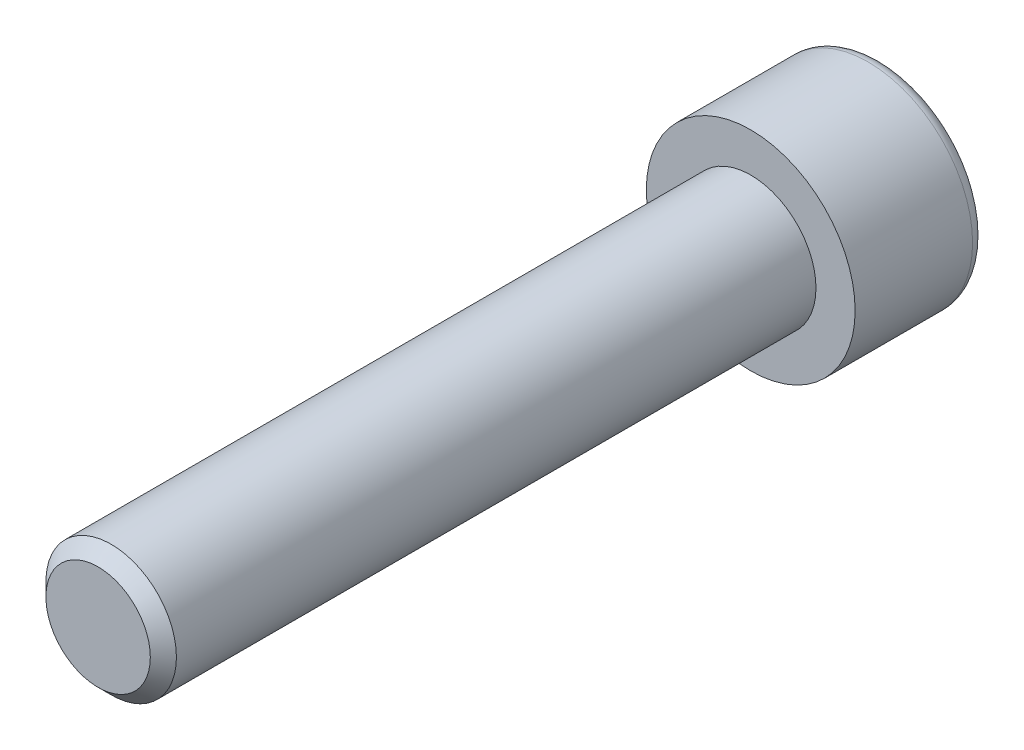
ISO-10303-21;
HEADER;
FILE_DESCRIPTION(('STEP AP214'),'2;1');
FILE_NAME('part.step','',(''),(''),'','','');
FILE_SCHEMA(('AUTOMOTIVE_DESIGN { 1 0 10303 214 1 1 1 1 }'));
ENDSEC;
DATA;
#1=APPLICATION_CONTEXT('core data for automotive mechanical design processes');
#2=APPLICATION_PROTOCOL_DEFINITION('international standard','automotive_design',2000,#1);
#3=PRODUCT_CONTEXT('',#1,'mechanical');
#4=PRODUCT('Part','Part','',(#3));
#5=PRODUCT_RELATED_PRODUCT_CATEGORY('part','',(#4));
#6=PRODUCT_DEFINITION_FORMATION('','',#4);
#7=PRODUCT_DEFINITION_CONTEXT('part definition',#1,'design');
#8=PRODUCT_DEFINITION('design','',#6,#7);
#9=PRODUCT_DEFINITION_SHAPE('','',#8);
#10=(LENGTH_UNIT() NAMED_UNIT(*) SI_UNIT(.MILLI.,.METRE.));
#11=(NAMED_UNIT(*) PLANE_ANGLE_UNIT() SI_UNIT($,.RADIAN.));
#12=(NAMED_UNIT(*) SI_UNIT($,.STERADIAN.) SOLID_ANGLE_UNIT());
#13=UNCERTAINTY_MEASURE_WITH_UNIT(LENGTH_MEASURE(1.E-05),#10,'distance_accuracy_value','');
#14=(GEOMETRIC_REPRESENTATION_CONTEXT(3) GLOBAL_UNCERTAINTY_ASSIGNED_CONTEXT((#13)) GLOBAL_UNIT_ASSIGNED_CONTEXT((#10,
#11,#12)) REPRESENTATION_CONTEXT('',''));
#15=CARTESIAN_POINT('',(0.,0.,0.));
#16=DIRECTION('',(0.,0.,1.));
#17=DIRECTION('',(1.,0.,0.));
#18=AXIS2_PLACEMENT_3D('',#15,#16,#17);
#19=CARTESIAN_POINT('',(0.,0.,-10.));
#20=DIRECTION('',(0.,0.,1.));
#21=DIRECTION('',(1.,0.,0.));
#22=AXIS2_PLACEMENT_3D('',#19,#20,#21);
#23=PLANE('',#22);
#24=CARTESIAN_POINT('',(0.,0.,-10.));
#25=DIRECTION('',(0.,0.,-1.));
#26=DIRECTION('',(-1.,0.,0.));
#27=AXIS2_PLACEMENT_3D('',#24,#25,#26);
#28=CIRCLE('',#27,7.);
#29=CARTESIAN_POINT('',(-7.00000000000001,0.,-10.));
#30=VERTEX_POINT('',#29);
#31=EDGE_CURVE('E141',#30,#30,#28,.T.);
#32=ORIENTED_EDGE('',*,*,#31,.T.);
#33=EDGE_LOOP('',(#32));
#34=FACE_BOUND('',#33,.T.);
#35=DIRECTION('',(-0.866025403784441,0.499999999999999,0.));
#36=VECTOR('',#35,1.);
#37=CARTESIAN_POINT('',(0.,4.61880215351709,-10.));
#38=LINE('',#37,#36);
#39=CARTESIAN_POINT('',(3.99999999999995,2.30940107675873,-10.));
#40=VERTEX_POINT('',#39);
#41=CARTESIAN_POINT('',(0.,4.61880215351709,-10.));
#42=VERTEX_POINT('',#41);
#43=EDGE_CURVE('E45',#40,#42,#38,.T.);
#44=ORIENTED_EDGE('',*,*,#43,.T.);
#45=DIRECTION('',(-0.866025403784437,-0.500000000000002,0.));
#46=VECTOR('',#45,1.);
#47=CARTESIAN_POINT('',(0.,4.61880215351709,-10.));
#48=LINE('',#47,#46);
#49=CARTESIAN_POINT('',(-3.99999999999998,2.30940107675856,-10.));
#50=VERTEX_POINT('',#49);
#51=EDGE_CURVE('E85',#42,#50,#48,.T.);
#52=ORIENTED_EDGE('',*,*,#51,.T.);
#53=DIRECTION('',(0.,-1.,0.));
#54=VECTOR('',#53,1.);
#55=CARTESIAN_POINT('',(-3.99999999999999,-2.30940107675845,-10.));
#56=LINE('',#55,#54);
#57=CARTESIAN_POINT('',(-3.99999999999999,-2.30940107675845,-10.));
#58=VERTEX_POINT('',#57);
#59=EDGE_CURVE('E93',#50,#58,#56,.T.);
#60=ORIENTED_EDGE('',*,*,#59,.T.);
#61=DIRECTION('',(0.866025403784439,-0.500000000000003,0.));
#62=VECTOR('',#61,1.);
#63=CARTESIAN_POINT('',(0.,-4.61880215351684,-10.));
#64=LINE('',#63,#62);
#65=CARTESIAN_POINT('',(0.,-4.61880215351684,-10.));
#66=VERTEX_POINT('',#65);
#67=EDGE_CURVE('E111',#58,#66,#64,.T.);
#68=ORIENTED_EDGE('',*,*,#67,.T.);
#69=DIRECTION('',(0.86602540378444,0.499999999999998,0.));
#70=VECTOR('',#69,1.);
#71=CARTESIAN_POINT('',(0.,-4.61880215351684,-10.));
#72=LINE('',#71,#70);
#73=CARTESIAN_POINT('',(3.99999999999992,-2.30940107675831,-10.));
#74=VERTEX_POINT('',#73);
#75=EDGE_CURVE('E114',#66,#74,#72,.T.);
#76=ORIENTED_EDGE('',*,*,#75,.T.);
#77=DIRECTION('',(0.,1.,0.));
#78=VECTOR('',#77,1.);
#79=CARTESIAN_POINT('',(3.99999999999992,-2.30940107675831,-10.));
#80=LINE('',#79,#78);
#81=EDGE_CURVE('E104',#74,#40,#80,.T.);
#82=ORIENTED_EDGE('',*,*,#81,.T.);
#83=EDGE_LOOP('',(#44,#52,#60,#68,#76,#82));
#84=FACE_BOUND('',#83,.T.);
#85=ADVANCED_FACE('F31',(#34,#84),#23,.F.);
#86=CARTESIAN_POINT('',(0.,0.,-9.00000000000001));
#87=DIRECTION('',(0.,0.,-1.));
#88=DIRECTION('',(-1.,0.,0.));
#89=AXIS2_PLACEMENT_3D('',#86,#87,#88);
#90=TOROIDAL_SURFACE('',#89,7.,0.999999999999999);
#91=ORIENTED_EDGE('',*,*,#31,.F.);
#92=EDGE_LOOP('',(#91));
#93=FACE_BOUND('',#92,.T.);
#94=CARTESIAN_POINT('',(0.,0.,-9.00000000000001));
#95=DIRECTION('',(0.,0.,-1.));
#96=DIRECTION('',(-1.,0.,0.));
#97=AXIS2_PLACEMENT_3D('',#94,#95,#96);
#98=CIRCLE('',#97,8.);
#99=CARTESIAN_POINT('',(-8.00000000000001,0.,-9.00000000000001));
#100=VERTEX_POINT('',#99);
#101=EDGE_CURVE('E138',#100,#100,#98,.T.);
#102=ORIENTED_EDGE('',*,*,#101,.T.);
#103=EDGE_LOOP('',(#102));
#104=FACE_BOUND('',#103,.T.);
#105=ADVANCED_FACE('F160',(#93,#104),#90,.T.);
#106=CARTESIAN_POINT('',(0.,0.,0.));
#107=DIRECTION('',(0.,0.,-1.));
#108=DIRECTION('',(-1.,0.,0.));
#109=AXIS2_PLACEMENT_3D('',#106,#107,#108);
#110=CYLINDRICAL_SURFACE('',#109,8.);
#111=ORIENTED_EDGE('',*,*,#101,.F.);
#112=EDGE_LOOP('',(#111));
#113=FACE_BOUND('',#112,.T.);
#114=CARTESIAN_POINT('',(0.,0.,0.));
#115=DIRECTION('',(0.,0.,-1.));
#116=DIRECTION('',(-1.,0.,0.));
#117=AXIS2_PLACEMENT_3D('',#114,#115,#116);
#118=CIRCLE('',#117,8.);
#119=CARTESIAN_POINT('',(-7.99999999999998,0.,0.));
#120=VERTEX_POINT('',#119);
#121=EDGE_CURVE('E99',#120,#120,#118,.T.);
#122=ORIENTED_EDGE('',*,*,#121,.T.);
#123=EDGE_LOOP('',(#122));
#124=FACE_BOUND('',#123,.T.);
#125=ADVANCED_FACE('F165',(#113,#124),#110,.T.);
#126=CARTESIAN_POINT('',(0.,0.,0.));
#127=DIRECTION('',(0.,0.,-1.));
#128=DIRECTION('',(-1.,0.,0.));
#129=AXIS2_PLACEMENT_3D('',#126,#127,#128);
#130=PLANE('',#129);
#131=CARTESIAN_POINT('',(0.,0.,0.));
#132=DIRECTION('',(0.,0.,1.));
#133=DIRECTION('',(1.,0.,0.));
#134=AXIS2_PLACEMENT_3D('',#131,#132,#133);
#135=CIRCLE('',#134,5.);
#136=CARTESIAN_POINT('',(5.00000000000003,0.,0.));
#137=VERTEX_POINT('',#136);
#138=EDGE_CURVE('E105',#137,#137,#135,.T.);
#139=ORIENTED_EDGE('',*,*,#138,.F.);
#140=EDGE_LOOP('',(#139));
#141=FACE_BOUND('',#140,.T.);
#142=ORIENTED_EDGE('',*,*,#121,.F.);
#143=EDGE_LOOP('',(#142));
#144=FACE_BOUND('',#143,.T.);
#145=ADVANCED_FACE('F173',(#141,#144),#130,.F.);
#146=CARTESIAN_POINT('',(0.,4.61880215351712,-5.));
#147=DIRECTION('',(-0.499999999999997,-0.866025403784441,0.));
#148=DIRECTION('',(0.866025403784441,-0.499999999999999,0.));
#149=AXIS2_PLACEMENT_3D('',#146,#147,#148);
#150=PLANE('',#149);
#151=ORIENTED_EDGE('',*,*,#43,.F.);
#152=DIRECTION('',(0.,0.,-1.));
#153=VECTOR('',#152,1.);
#154=CARTESIAN_POINT('',(3.99999999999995,2.30940107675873,-5.));
#155=LINE('',#154,#153);
#156=CARTESIAN_POINT('',(3.99999999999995,2.30940107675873,-5.));
#157=VERTEX_POINT('',#156);
#158=EDGE_CURVE('E127',#157,#40,#155,.T.);
#159=ORIENTED_EDGE('',*,*,#158,.F.);
#160=DIRECTION('',(-0.866025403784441,0.499999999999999,0.));
#161=VECTOR('',#160,1.);
#162=CARTESIAN_POINT('',(0.,4.61880215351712,-5.));
#163=LINE('',#162,#161);
#164=CARTESIAN_POINT('',(0.,4.61880215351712,-5.));
#165=VERTEX_POINT('',#164);
#166=EDGE_CURVE('E98',#157,#165,#163,.T.);
#167=ORIENTED_EDGE('',*,*,#166,.T.);
#168=DIRECTION('',(0.,0.,-1.));
#169=VECTOR('',#168,1.);
#170=CARTESIAN_POINT('',(0.,4.61880215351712,-5.));
#171=LINE('',#170,#169);
#172=EDGE_CURVE('E87',#165,#42,#171,.T.);
#173=ORIENTED_EDGE('',*,*,#172,.T.);
#174=EDGE_LOOP('',(#151,#159,#167,#173));
#175=FACE_BOUND('',#174,.T.);
#176=ADVANCED_FACE('F96',(#175),#150,.T.);
#177=CARTESIAN_POINT('',(0.,4.61880215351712,-5.));
#178=DIRECTION('',(0.500000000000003,-0.866025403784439,0.));
#179=DIRECTION('',(0.866025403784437,0.500000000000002,0.));
#180=AXIS2_PLACEMENT_3D('',#177,#178,#179);
#181=PLANE('',#180);
#182=ORIENTED_EDGE('',*,*,#51,.F.);
#183=ORIENTED_EDGE('',*,*,#172,.F.);
#184=DIRECTION('',(-0.866025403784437,-0.500000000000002,0.));
#185=VECTOR('',#184,1.);
#186=CARTESIAN_POINT('',(0.,4.61880215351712,-5.));
#187=LINE('',#186,#185);
#188=CARTESIAN_POINT('',(-3.99999999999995,2.30940107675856,-5.));
#189=VERTEX_POINT('',#188);
#190=EDGE_CURVE('E118',#165,#189,#187,.T.);
#191=ORIENTED_EDGE('',*,*,#190,.T.);
#192=DIRECTION('',(0.,0.,-1.));
#193=VECTOR('',#192,1.);
#194=CARTESIAN_POINT('',(-3.99999999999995,2.30940107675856,-5.));
#195=LINE('',#194,#193);
#196=EDGE_CURVE('E89',#189,#50,#195,.T.);
#197=ORIENTED_EDGE('',*,*,#196,.T.);
#198=EDGE_LOOP('',(#182,#183,#191,#197));
#199=FACE_BOUND('',#198,.T.);
#200=ADVANCED_FACE('F86',(#199),#181,.T.);
#201=CARTESIAN_POINT('',(-3.99999999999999,-2.30940107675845,-5.));
#202=DIRECTION('',(1.,0.,0.));
#203=DIRECTION('',(0.,0.,-1.));
#204=AXIS2_PLACEMENT_3D('',#201,#202,#203);
#205=PLANE('',#204);
#206=ORIENTED_EDGE('',*,*,#59,.F.);
#207=ORIENTED_EDGE('',*,*,#196,.F.);
#208=DIRECTION('',(0.,-1.,0.));
#209=VECTOR('',#208,1.);
#210=CARTESIAN_POINT('',(-3.99999999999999,-2.30940107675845,-5.));
#211=LINE('',#210,#209);
#212=CARTESIAN_POINT('',(-3.99999999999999,-2.30940107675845,-5.));
#213=VERTEX_POINT('',#212);
#214=EDGE_CURVE('E120',#189,#213,#211,.T.);
#215=ORIENTED_EDGE('',*,*,#214,.T.);
#216=DIRECTION('',(0.,0.,-1.));
#217=VECTOR('',#216,1.);
#218=CARTESIAN_POINT('',(-3.99999999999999,-2.30940107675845,-5.));
#219=LINE('',#218,#217);
#220=EDGE_CURVE('E133',#213,#58,#219,.T.);
#221=ORIENTED_EDGE('',*,*,#220,.T.);
#222=EDGE_LOOP('',(#206,#207,#215,#221));
#223=FACE_BOUND('',#222,.T.);
#224=ADVANCED_FACE('F188',(#223),#205,.T.);
#225=CARTESIAN_POINT('',(0.,-4.61880215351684,-5.));
#226=DIRECTION('',(0.500000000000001,0.866025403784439,0.));
#227=DIRECTION('',(-0.866025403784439,0.500000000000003,0.));
#228=AXIS2_PLACEMENT_3D('',#225,#226,#227);
#229=PLANE('',#228);
#230=ORIENTED_EDGE('',*,*,#67,.F.);
#231=ORIENTED_EDGE('',*,*,#220,.F.);
#232=DIRECTION('',(0.866025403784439,-0.500000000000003,0.));
#233=VECTOR('',#232,1.);
#234=CARTESIAN_POINT('',(0.,-4.61880215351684,-5.));
#235=LINE('',#234,#233);
#236=CARTESIAN_POINT('',(0.,-4.61880215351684,-5.));
#237=VERTEX_POINT('',#236);
#238=EDGE_CURVE('E122',#213,#237,#235,.T.);
#239=ORIENTED_EDGE('',*,*,#238,.T.);
#240=DIRECTION('',(0.,0.,-1.));
#241=VECTOR('',#240,1.);
#242=CARTESIAN_POINT('',(0.,-4.61880215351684,-5.));
#243=LINE('',#242,#241);
#244=EDGE_CURVE('E131',#237,#66,#243,.T.);
#245=ORIENTED_EDGE('',*,*,#244,.T.);
#246=EDGE_LOOP('',(#230,#231,#239,#245));
#247=FACE_BOUND('',#246,.T.);
#248=ADVANCED_FACE('F191',(#247),#229,.T.);
#249=CARTESIAN_POINT('',(0.,-4.61880215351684,-5.));
#250=DIRECTION('',(-0.499999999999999,0.866025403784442,0.));
#251=DIRECTION('',(-0.86602540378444,-0.499999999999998,0.));
#252=AXIS2_PLACEMENT_3D('',#249,#250,#251);
#253=PLANE('',#252);
#254=ORIENTED_EDGE('',*,*,#75,.F.);
#255=ORIENTED_EDGE('',*,*,#244,.F.);
#256=DIRECTION('',(0.86602540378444,0.499999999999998,0.));
#257=VECTOR('',#256,1.);
#258=CARTESIAN_POINT('',(0.,-4.61880215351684,-5.));
#259=LINE('',#258,#257);
#260=CARTESIAN_POINT('',(3.99999999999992,-2.30940107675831,-5.));
#261=VERTEX_POINT('',#260);
#262=EDGE_CURVE('E124',#237,#261,#259,.T.);
#263=ORIENTED_EDGE('',*,*,#262,.T.);
#264=DIRECTION('',(0.,0.,-1.));
#265=VECTOR('',#264,1.);
#266=CARTESIAN_POINT('',(3.99999999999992,-2.30940107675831,-5.));
#267=LINE('',#266,#265);
#268=EDGE_CURVE('E129',#261,#74,#267,.T.);
#269=ORIENTED_EDGE('',*,*,#268,.T.);
#270=EDGE_LOOP('',(#254,#255,#263,#269));
#271=FACE_BOUND('',#270,.T.);
#272=ADVANCED_FACE('F195',(#271),#253,.T.);
#273=CARTESIAN_POINT('',(3.99999999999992,-2.30940107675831,-5.));
#274=DIRECTION('',(-1.,0.,0.));
#275=DIRECTION('',(0.,-1.,0.));
#276=AXIS2_PLACEMENT_3D('',#273,#274,#275);
#277=PLANE('',#276);
#278=ORIENTED_EDGE('',*,*,#81,.F.);
#279=ORIENTED_EDGE('',*,*,#268,.F.);
#280=DIRECTION('',(0.,1.,0.));
#281=VECTOR('',#280,1.);
#282=CARTESIAN_POINT('',(3.99999999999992,-2.30940107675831,-5.));
#283=LINE('',#282,#281);
#284=EDGE_CURVE('E52',#261,#157,#283,.T.);
#285=ORIENTED_EDGE('',*,*,#284,.T.);
#286=ORIENTED_EDGE('',*,*,#158,.T.);
#287=EDGE_LOOP('',(#278,#279,#285,#286));
#288=FACE_BOUND('',#287,.T.);
#289=ADVANCED_FACE('F199',(#288),#277,.T.);
#290=CARTESIAN_POINT('',(3.99999999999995,2.30940107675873,-5.));
#291=DIRECTION('',(0.,0.,1.));
#292=DIRECTION('',(1.,0.,0.));
#293=AXIS2_PLACEMENT_3D('',#290,#291,#292);
#294=PLANE('',#293);
#295=ORIENTED_EDGE('',*,*,#166,.F.);
#296=ORIENTED_EDGE('',*,*,#284,.F.);
#297=ORIENTED_EDGE('',*,*,#262,.F.);
#298=ORIENTED_EDGE('',*,*,#238,.F.);
#299=ORIENTED_EDGE('',*,*,#214,.F.);
#300=ORIENTED_EDGE('',*,*,#190,.F.);
#301=EDGE_LOOP('',(#295,#296,#297,#298,#299,#300));
#302=FACE_BOUND('',#301,.T.);
#303=ADVANCED_FACE('F203',(#302),#294,.F.);
#304=CARTESIAN_POINT('',(0.,0.,50.));
#305=DIRECTION('',(0.,0.,1.));
#306=DIRECTION('',(1.,0.,0.));
#307=AXIS2_PLACEMENT_3D('',#304,#305,#306);
#308=PLANE('',#307);
#309=CARTESIAN_POINT('',(0.,0.,50.));
#310=DIRECTION('',(0.,0.,1.));
#311=DIRECTION('',(1.,0.,0.));
#312=AXIS2_PLACEMENT_3D('',#309,#310,#311);
#313=CIRCLE('',#312,4.);
#314=CARTESIAN_POINT('',(4.00000000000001,0.,50.));
#315=VERTEX_POINT('',#314);
#316=EDGE_CURVE('E38',#315,#315,#313,.T.);
#317=ORIENTED_EDGE('',*,*,#316,.T.);
#318=EDGE_LOOP('',(#317));
#319=FACE_BOUND('',#318,.T.);
#320=ADVANCED_FACE('F146',(#319),#308,.T.);
#321=CARTESIAN_POINT('',(0.,0.,0.));
#322=DIRECTION('',(0.,0.,1.));
#323=DIRECTION('',(1.,0.,0.));
#324=AXIS2_PLACEMENT_3D('',#321,#322,#323);
#325=CYLINDRICAL_SURFACE('',#324,5.);
#326=CARTESIAN_POINT('',(0.,0.,49.));
#327=DIRECTION('',(0.,0.,1.));
#328=DIRECTION('',(1.,0.,0.));
#329=AXIS2_PLACEMENT_3D('',#326,#327,#328);
#330=CIRCLE('',#329,5.);
#331=CARTESIAN_POINT('',(5.00000000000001,0.,49.));
#332=VERTEX_POINT('',#331);
#333=EDGE_CURVE('E11',#332,#332,#330,.F.);
#334=ORIENTED_EDGE('',*,*,#333,.T.);
#335=EDGE_LOOP('',(#334));
#336=FACE_BOUND('',#335,.T.);
#337=ORIENTED_EDGE('',*,*,#138,.T.);
#338=EDGE_LOOP('',(#337));
#339=FACE_BOUND('',#338,.T.);
#340=ADVANCED_FACE('F150',(#336,#339),#325,.T.);
#341=CARTESIAN_POINT('',(0.,0.,50.));
#342=DIRECTION('',(0.,0.,-1.));
#343=DIRECTION('',(-1.,0.,0.));
#344=AXIS2_PLACEMENT_3D('',#341,#342,#343);
#345=CONICAL_SURFACE('',#344,4.,0.785398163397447);
#346=ORIENTED_EDGE('',*,*,#333,.F.);
#347=EDGE_LOOP('',(#346));
#348=FACE_BOUND('',#347,.T.);
#349=ORIENTED_EDGE('',*,*,#316,.F.);
#350=EDGE_LOOP('',(#349));
#351=FACE_BOUND('',#350,.T.);
#352=ADVANCED_FACE('F148',(#348,#351),#345,.T.);
#353=CLOSED_SHELL('',(#85,#105,#125,#145,#176,#200,#224,#248,#272,#289,#303,#320,#340,#352));
#354=MANIFOLD_SOLID_BREP('B2',#353);
#355=ADVANCED_BREP_SHAPE_REPRESENTATION('',(#18,#354),#14);
#356=SHAPE_DEFINITION_REPRESENTATION(#9,#355);
ENDSEC;
END-ISO-10303-21;
